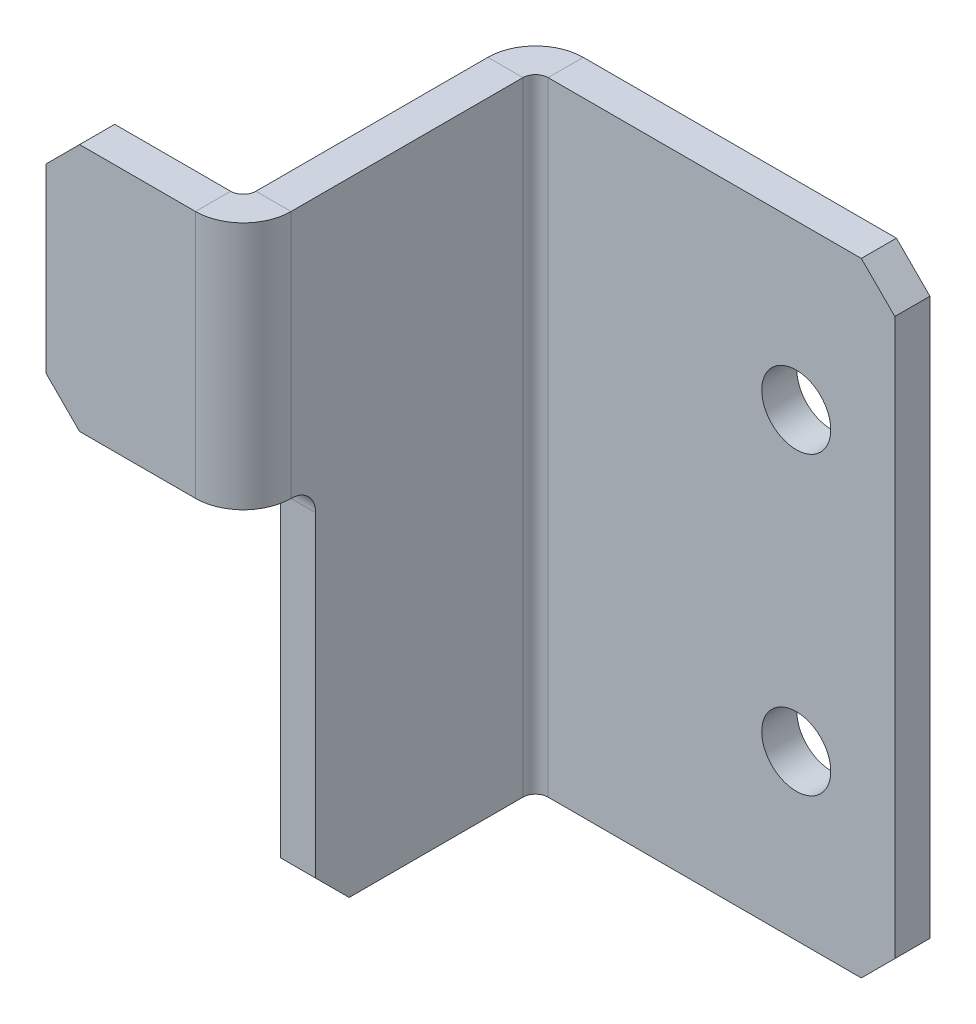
ISO-10303-21;
HEADER;
FILE_DESCRIPTION(('STEP AP214'),'2;1');
FILE_NAME('part.step','',(''),(''),'','','');
FILE_SCHEMA(('AUTOMOTIVE_DESIGN { 1 0 10303 214 1 1 1 1 }'));
ENDSEC;
DATA;
#1=APPLICATION_CONTEXT('core data for automotive mechanical design processes');
#2=APPLICATION_PROTOCOL_DEFINITION('international standard','automotive_design',2000,#1);
#3=PRODUCT_CONTEXT('',#1,'mechanical');
#4=PRODUCT('Part','Part','',(#3));
#5=PRODUCT_RELATED_PRODUCT_CATEGORY('part','',(#4));
#6=PRODUCT_DEFINITION_FORMATION('','',#4);
#7=PRODUCT_DEFINITION_CONTEXT('part definition',#1,'design');
#8=PRODUCT_DEFINITION('design','',#6,#7);
#9=PRODUCT_DEFINITION_SHAPE('','',#8);
#10=(LENGTH_UNIT() NAMED_UNIT(*) SI_UNIT(.MILLI.,.METRE.));
#11=(NAMED_UNIT(*) PLANE_ANGLE_UNIT() SI_UNIT($,.RADIAN.));
#12=(NAMED_UNIT(*) SI_UNIT($,.STERADIAN.) SOLID_ANGLE_UNIT());
#13=UNCERTAINTY_MEASURE_WITH_UNIT(LENGTH_MEASURE(1.E-05),#10,'distance_accuracy_value','');
#14=(GEOMETRIC_REPRESENTATION_CONTEXT(3) GLOBAL_UNCERTAINTY_ASSIGNED_CONTEXT((#13)) GLOBAL_UNIT_ASSIGNED_CONTEXT((#10,
#11,#12)) REPRESENTATION_CONTEXT('',''));
#15=CARTESIAN_POINT('',(0.,0.,0.));
#16=DIRECTION('',(0.,0.,1.));
#17=DIRECTION('',(1.,0.,0.));
#18=AXIS2_PLACEMENT_3D('',#15,#16,#17);
#19=CARTESIAN_POINT('',(-12.7,-20.066,2.26060000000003));
#20=DIRECTION('',(0.,1.,0.));
#21=DIRECTION('',(0.,0.,1.));
#22=AXIS2_PLACEMENT_3D('',#19,#20,#21);
#23=PLANE('',#22);
#24=DIRECTION('',(0.,0.,-1.));
#25=VECTOR('',#24,1.);
#26=CARTESIAN_POINT('',(-12.7,-20.066,0.));
#27=LINE('',#26,#25);
#28=CARTESIAN_POINT('',(-12.7,-20.066,14.2621000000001));
#29=VERTEX_POINT('',#28);
#30=CARTESIAN_POINT('',(-12.7,-20.066,3.07340000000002));
#31=VERTEX_POINT('',#30);
#32=EDGE_CURVE('E271',#29,#31,#27,.T.);
#33=ORIENTED_EDGE('',*,*,#32,.T.);
#34=DIRECTION('',(-1.,0.,0.));
#35=VECTOR('',#34,1.);
#36=CARTESIAN_POINT('',(-12.7,-20.066,3.07340000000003));
#37=LINE('',#36,#35);
#38=CARTESIAN_POINT('',(-10.4394,-20.066,3.07340000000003));
#39=VERTEX_POINT('',#38);
#40=EDGE_CURVE('E287',#39,#31,#37,.T.);
#41=ORIENTED_EDGE('',*,*,#40,.F.);
#42=DIRECTION('',(0.,0.,1.));
#43=VECTOR('',#42,1.);
#44=CARTESIAN_POINT('',(-10.4394,-20.066,2.26060000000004));
#45=LINE('',#44,#43);
#46=CARTESIAN_POINT('',(-10.4394,-20.066,14.2621000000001));
#47=VERTEX_POINT('',#46);
#48=EDGE_CURVE('E266',#47,#39,#45,.F.);
#49=ORIENTED_EDGE('',*,*,#48,.F.);
#50=DIRECTION('',(1.,0.,0.));
#51=VECTOR('',#50,1.);
#52=CARTESIAN_POINT('',(-12.7,-20.066,14.2621000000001));
#53=LINE('',#52,#51);
#54=EDGE_CURVE('E336',#29,#47,#53,.T.);
#55=ORIENTED_EDGE('',*,*,#54,.F.);
#56=EDGE_LOOP('',(#33,#41,#49,#55));
#57=FACE_BOUND('',#56,.T.);
#58=ADVANCED_FACE('F39',(#57),#23,.F.);
#59=CARTESIAN_POINT('',(-12.7,20.066,21.082));
#60=DIRECTION('',(0.,-1.,0.));
#61=DIRECTION('',(0.,0.,-1.));
#62=AXIS2_PLACEMENT_3D('',#59,#60,#61);
#63=PLANE('',#62);
#64=DIRECTION('',(1.,0.,0.));
#65=VECTOR('',#64,1.);
#66=CARTESIAN_POINT('',(-12.7,20.066,18.0086));
#67=LINE('',#66,#65);
#68=CARTESIAN_POINT('',(-12.7,20.066,18.0086));
#69=VERTEX_POINT('',#68);
#70=CARTESIAN_POINT('',(-10.4394,20.066,18.0086));
#71=VERTEX_POINT('',#70);
#72=EDGE_CURVE('E296',#69,#71,#67,.T.);
#73=ORIENTED_EDGE('',*,*,#72,.T.);
#74=DIRECTION('',(0.,0.,-1.));
#75=VECTOR('',#74,1.);
#76=CARTESIAN_POINT('',(-10.4394,20.066,21.082));
#77=LINE('',#76,#75);
#78=CARTESIAN_POINT('',(-10.4394,20.066,3.0734));
#79=VERTEX_POINT('',#78);
#80=EDGE_CURVE('E274',#79,#71,#77,.F.);
#81=ORIENTED_EDGE('',*,*,#80,.F.);
#82=DIRECTION('',(-1.,0.,0.));
#83=VECTOR('',#82,1.);
#84=CARTESIAN_POINT('',(-10.4394,20.066,3.07340000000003));
#85=LINE('',#84,#83);
#86=CARTESIAN_POINT('',(-12.7,20.066,3.07340000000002));
#87=VERTEX_POINT('',#86);
#88=EDGE_CURVE('E281',#79,#87,#85,.T.);
#89=ORIENTED_EDGE('',*,*,#88,.T.);
#90=DIRECTION('',(0.,0.,1.));
#91=VECTOR('',#90,1.);
#92=CARTESIAN_POINT('',(-12.7,20.066,0.));
#93=LINE('',#92,#91);
#94=EDGE_CURVE('E267',#87,#69,#93,.T.);
#95=ORIENTED_EDGE('',*,*,#94,.T.);
#96=EDGE_LOOP('',(#73,#81,#89,#95));
#97=FACE_BOUND('',#96,.T.);
#98=ADVANCED_FACE('F365',(#97),#63,.F.);
#99=CARTESIAN_POINT('',(-12.7,0.,0.));
#100=DIRECTION('',(1.,0.,0.));
#101=DIRECTION('',(0.,0.,1.));
#102=AXIS2_PLACEMENT_3D('',#99,#100,#101);
#103=PLANE('',#102);
#104=DIRECTION('',(0.,-1.,0.));
#105=VECTOR('',#104,1.);
#106=CARTESIAN_POINT('',(-12.7000000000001,-20.066,16.4211000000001));
#107=LINE('',#106,#105);
#108=CARTESIAN_POINT('',(-12.7000000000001,2.47650000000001,16.4211000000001));
#109=VERTEX_POINT('',#108);
#110=CARTESIAN_POINT('',(-12.7000000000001,-17.907,16.4211000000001));
#111=VERTEX_POINT('',#110);
#112=EDGE_CURVE('E257',#109,#111,#107,.T.);
#113=ORIENTED_EDGE('',*,*,#112,.F.);
#114=CARTESIAN_POINT('',(-12.7000000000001,2.47650000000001,18.0086000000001));
#115=DIRECTION('',(-1.,0.,0.));
#116=DIRECTION('',(0.,0.,1.));
#117=AXIS2_PLACEMENT_3D('',#114,#115,#116);
#118=CIRCLE('',#117,1.5875);
#119=CARTESIAN_POINT('',(-12.7000000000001,4.06400000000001,18.0086000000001));
#120=VERTEX_POINT('',#119);
#121=EDGE_CURVE('E254',#120,#109,#118,.T.);
#122=ORIENTED_EDGE('',*,*,#121,.F.);
#123=DIRECTION('',(0.,1.,0.));
#124=VECTOR('',#123,1.);
#125=CARTESIAN_POINT('',(-12.7000000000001,-20.066,18.0086));
#126=LINE('',#125,#124);
#127=EDGE_CURVE('E293',#120,#69,#126,.T.);
#128=ORIENTED_EDGE('',*,*,#127,.T.);
#129=ORIENTED_EDGE('',*,*,#94,.F.);
#130=DIRECTION('',(0.,-1.,0.));
#131=VECTOR('',#130,1.);
#132=CARTESIAN_POINT('',(-12.7,-20.066,3.07340000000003));
#133=LINE('',#132,#131);
#134=EDGE_CURVE('E284',#87,#31,#133,.T.);
#135=ORIENTED_EDGE('',*,*,#134,.T.);
#136=ORIENTED_EDGE('',*,*,#32,.F.);
#137=DIRECTION('',(0.,0.707106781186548,0.707106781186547));
#138=VECTOR('',#137,1.);
#139=CARTESIAN_POINT('',(-12.7,-20.066,14.2621000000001));
#140=LINE('',#139,#138);
#141=EDGE_CURVE('E11',#111,#29,#140,.F.);
#142=ORIENTED_EDGE('',*,*,#141,.F.);
#143=EDGE_LOOP('',(#113,#122,#128,#129,#135,#136,#142));
#144=FACE_BOUND('',#143,.T.);
#145=ADVANCED_FACE('F352',(#144),#103,.F.);
#146=CARTESIAN_POINT('',(-10.4394,0.,0.));
#147=DIRECTION('',(1.,0.,0.));
#148=DIRECTION('',(0.,0.,1.));
#149=AXIS2_PLACEMENT_3D('',#146,#147,#148);
#150=PLANE('',#149);
#151=ORIENTED_EDGE('',*,*,#48,.T.);
#152=DIRECTION('',(0.,1.,0.));
#153=VECTOR('',#152,1.);
#154=CARTESIAN_POINT('',(-10.4394,-20.066,3.07340000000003));
#155=LINE('',#154,#153);
#156=EDGE_CURVE('E270',#39,#79,#155,.T.);
#157=ORIENTED_EDGE('',*,*,#156,.T.);
#158=ORIENTED_EDGE('',*,*,#80,.T.);
#159=DIRECTION('',(0.,1.,0.));
#160=VECTOR('',#159,1.);
#161=CARTESIAN_POINT('',(-10.4394000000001,-20.066,18.0086000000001));
#162=LINE('',#161,#160);
#163=CARTESIAN_POINT('',(-10.4394000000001,4.06400000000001,18.0086000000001));
#164=VERTEX_POINT('',#163);
#165=EDGE_CURVE('E290',#164,#71,#162,.T.);
#166=ORIENTED_EDGE('',*,*,#165,.F.);
#167=CARTESIAN_POINT('',(-10.4394000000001,2.47650000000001,18.0086000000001));
#168=DIRECTION('',(-1.,0.,0.));
#169=DIRECTION('',(0.,0.,1.));
#170=AXIS2_PLACEMENT_3D('',#167,#168,#169);
#171=CIRCLE('',#170,1.5875);
#172=CARTESIAN_POINT('',(-10.4394000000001,2.47650000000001,16.4211000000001));
#173=VERTEX_POINT('',#172);
#174=EDGE_CURVE('E227',#164,#173,#171,.T.);
#175=ORIENTED_EDGE('',*,*,#174,.T.);
#176=DIRECTION('',(0.,-1.,0.));
#177=VECTOR('',#176,1.);
#178=CARTESIAN_POINT('',(-10.4394000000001,-20.066,16.4211000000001));
#179=LINE('',#178,#177);
#180=CARTESIAN_POINT('',(-10.4394000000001,-17.907,16.4211000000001));
#181=VERTEX_POINT('',#180);
#182=EDGE_CURVE('E258',#173,#181,#179,.T.);
#183=ORIENTED_EDGE('',*,*,#182,.T.);
#184=DIRECTION('',(0.,-0.707106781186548,-0.707106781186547));
#185=VECTOR('',#184,1.);
#186=CARTESIAN_POINT('',(-10.4394,-17.16405,17.16405));
#187=LINE('',#186,#185);
#188=EDGE_CURVE('E339',#47,#181,#187,.F.);
#189=ORIENTED_EDGE('',*,*,#188,.F.);
#190=EDGE_LOOP('',(#151,#157,#158,#166,#175,#183,#189));
#191=FACE_BOUND('',#190,.T.);
#192=ADVANCED_FACE('F343',(#191),#150,.T.);
#193=CARTESIAN_POINT('',(-12.7000000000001,-20.066,16.4211000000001));
#194=DIRECTION('',(0.,0.,-1.));
#195=DIRECTION('',(1.,0.,0.));
#196=AXIS2_PLACEMENT_3D('',#193,#194,#195);
#197=PLANE('',#196);
#198=ORIENTED_EDGE('',*,*,#182,.F.);
#199=DIRECTION('',(1.,0.,0.));
#200=VECTOR('',#199,1.);
#201=CARTESIAN_POINT('',(-12.7000000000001,2.47650000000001,16.4211000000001));
#202=LINE('',#201,#200);
#203=EDGE_CURVE('E260',#109,#173,#202,.T.);
#204=ORIENTED_EDGE('',*,*,#203,.F.);
#205=ORIENTED_EDGE('',*,*,#112,.T.);
#206=DIRECTION('',(-1.,0.,0.));
#207=VECTOR('',#206,1.);
#208=CARTESIAN_POINT('',(-12.7000000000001,-17.907,16.4211000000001));
#209=LINE('',#208,#207);
#210=EDGE_CURVE('E47',#181,#111,#209,.T.);
#211=ORIENTED_EDGE('',*,*,#210,.F.);
#212=EDGE_LOOP('',(#198,#204,#205,#211));
#213=FACE_BOUND('',#212,.T.);
#214=ADVANCED_FACE('F345',(#213),#197,.F.);
#215=CARTESIAN_POINT('',(-12.7000000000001,2.47650000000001,18.0086000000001));
#216=DIRECTION('',(1.,0.,0.));
#217=DIRECTION('',(0.,0.,1.));
#218=AXIS2_PLACEMENT_3D('',#215,#216,#217);
#219=CYLINDRICAL_SURFACE('',#218,1.5875);
#220=ORIENTED_EDGE('',*,*,#174,.F.);
#221=DIRECTION('',(1.,0.,0.));
#222=VECTOR('',#221,1.);
#223=CARTESIAN_POINT('',(-12.7000000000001,4.06400000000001,18.0086000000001));
#224=LINE('',#223,#222);
#225=EDGE_CURVE('E203',#120,#164,#224,.T.);
#226=ORIENTED_EDGE('',*,*,#225,.F.);
#227=ORIENTED_EDGE('',*,*,#121,.T.);
#228=ORIENTED_EDGE('',*,*,#203,.T.);
#229=EDGE_LOOP('',(#220,#226,#227,#228));
#230=FACE_BOUND('',#229,.T.);
#231=ADVANCED_FACE('F349',(#230),#219,.F.);
#232=CARTESIAN_POINT('',(12.7,20.066,2.2606));
#233=DIRECTION('',(-1.,0.,0.));
#234=DIRECTION('',(0.,0.,-1.));
#235=AXIS2_PLACEMENT_3D('',#232,#233,#234);
#236=PLANE('',#235);
#237=DIRECTION('',(0.,-1.,0.));
#238=VECTOR('',#237,1.);
#239=CARTESIAN_POINT('',(12.7,20.066,0.));
#240=LINE('',#239,#238);
#241=CARTESIAN_POINT('',(12.7,17.907,0.));
#242=VERTEX_POINT('',#241);
#243=CARTESIAN_POINT('',(12.7,-17.907,0.));
#244=VERTEX_POINT('',#243);
#245=EDGE_CURVE('E246',#242,#244,#240,.T.);
#246=ORIENTED_EDGE('',*,*,#245,.F.);
#247=DIRECTION('',(0.,0.,-1.));
#248=VECTOR('',#247,1.);
#249=CARTESIAN_POINT('',(12.7,17.907,2.2606));
#250=LINE('',#249,#248);
#251=CARTESIAN_POINT('',(12.7,17.907,2.2606));
#252=VERTEX_POINT('',#251);
#253=EDGE_CURVE('E317',#252,#242,#250,.T.);
#254=ORIENTED_EDGE('',*,*,#253,.F.);
#255=DIRECTION('',(0.,-1.,0.));
#256=VECTOR('',#255,1.);
#257=CARTESIAN_POINT('',(12.7,20.066,2.2606));
#258=LINE('',#257,#256);
#259=CARTESIAN_POINT('',(12.7,-17.907,2.2606));
#260=VERTEX_POINT('',#259);
#261=EDGE_CURVE('E237',#252,#260,#258,.T.);
#262=ORIENTED_EDGE('',*,*,#261,.T.);
#263=DIRECTION('',(0.,0.,1.));
#264=VECTOR('',#263,1.);
#265=CARTESIAN_POINT('',(12.7,-17.907,2.2606));
#266=LINE('',#265,#264);
#267=EDGE_CURVE('E330',#244,#260,#266,.T.);
#268=ORIENTED_EDGE('',*,*,#267,.F.);
#269=EDGE_LOOP('',(#246,#254,#262,#268));
#270=FACE_BOUND('',#269,.T.);
#271=ADVANCED_FACE('F465',(#270),#236,.F.);
#272=CARTESIAN_POINT('',(12.7,-20.066,2.2606));
#273=DIRECTION('',(0.,0.,1.));
#274=DIRECTION('',(-1.,0.,0.));
#275=AXIS2_PLACEMENT_3D('',#272,#273,#274);
#276=PLANE('',#275);
#277=CARTESIAN_POINT('',(6.35000000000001,-9.525,2.2606));
#278=DIRECTION('',(0.,0.,-1.));
#279=DIRECTION('',(-1.,0.,0.));
#280=AXIS2_PLACEMENT_3D('',#277,#278,#279);
#281=CIRCLE('',#280,2.2225);
#282=CARTESIAN_POINT('',(4.12750000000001,-9.525,2.2606));
#283=VERTEX_POINT('',#282);
#284=EDGE_CURVE('E749',#283,#283,#281,.T.);
#285=ORIENTED_EDGE('',*,*,#284,.T.);
#286=EDGE_LOOP('',(#285));
#287=FACE_BOUND('',#286,.T.);
#288=CARTESIAN_POINT('',(6.35000000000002,9.525,2.2606));
#289=DIRECTION('',(0.,0.,-1.));
#290=DIRECTION('',(-1.,0.,0.));
#291=AXIS2_PLACEMENT_3D('',#288,#289,#290);
#292=CIRCLE('',#291,2.2225);
#293=CARTESIAN_POINT('',(4.12750000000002,9.525,2.2606));
#294=VERTEX_POINT('',#293);
#295=EDGE_CURVE('E751',#294,#294,#292,.T.);
#296=ORIENTED_EDGE('',*,*,#295,.T.);
#297=EDGE_LOOP('',(#296));
#298=FACE_BOUND('',#297,.T.);
#299=ORIENTED_EDGE('',*,*,#261,.F.);
#300=DIRECTION('',(-0.707106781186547,0.707106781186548,0.));
#301=VECTOR('',#300,1.);
#302=CARTESIAN_POINT('',(31.6865,-1.07950000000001,2.2606));
#303=LINE('',#302,#301);
#304=CARTESIAN_POINT('',(10.541,20.066,2.2606));
#305=VERTEX_POINT('',#304);
#306=EDGE_CURVE('E324',#305,#252,#303,.F.);
#307=ORIENTED_EDGE('',*,*,#306,.F.);
#308=DIRECTION('',(1.,0.,0.));
#309=VECTOR('',#308,1.);
#310=CARTESIAN_POINT('',(12.7,20.066,2.2606));
#311=LINE('',#310,#309);
#312=CARTESIAN_POINT('',(-9.6266,20.066,2.26060000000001));
#313=VERTEX_POINT('',#312);
#314=EDGE_CURVE('E240',#313,#305,#311,.T.);
#315=ORIENTED_EDGE('',*,*,#314,.F.);
#316=DIRECTION('',(0.,-1.,0.));
#317=VECTOR('',#316,1.);
#318=CARTESIAN_POINT('',(-9.6266,20.066,2.26060000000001));
#319=LINE('',#318,#317);
#320=CARTESIAN_POINT('',(-9.6266,-20.066,2.2606));
#321=VERTEX_POINT('',#320);
#322=EDGE_CURVE('E221',#313,#321,#319,.T.);
#323=ORIENTED_EDGE('',*,*,#322,.T.);
#324=DIRECTION('',(-1.,0.,0.));
#325=VECTOR('',#324,1.);
#326=CARTESIAN_POINT('',(12.7,-20.066,2.2606));
#327=LINE('',#326,#325);
#328=CARTESIAN_POINT('',(10.541,-20.066,2.2606));
#329=VERTEX_POINT('',#328);
#330=EDGE_CURVE('E243',#329,#321,#327,.T.);
#331=ORIENTED_EDGE('',*,*,#330,.F.);
#332=DIRECTION('',(0.707106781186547,0.707106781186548,0.));
#333=VECTOR('',#332,1.);
#334=CARTESIAN_POINT('',(11.6205,-18.9865,2.2606));
#335=LINE('',#334,#333);
#336=EDGE_CURVE('E333',#260,#329,#335,.F.);
#337=ORIENTED_EDGE('',*,*,#336,.F.);
#338=EDGE_LOOP('',(#299,#307,#315,#323,#331,#337));
#339=FACE_BOUND('',#338,.T.);
#340=ADVANCED_FACE('F402',(#287,#298,#339),#276,.T.);
#341=CARTESIAN_POINT('',(12.7,20.066,2.2606));
#342=DIRECTION('',(0.,-1.,0.));
#343=DIRECTION('',(0.,0.,-1.));
#344=AXIS2_PLACEMENT_3D('',#341,#342,#343);
#345=PLANE('',#344);
#346=DIRECTION('',(1.,0.,0.));
#347=VECTOR('',#346,1.);
#348=CARTESIAN_POINT('',(12.7,20.066,0.));
#349=LINE('',#348,#347);
#350=CARTESIAN_POINT('',(-9.6266,20.066,0.));
#351=VERTEX_POINT('',#350);
#352=CARTESIAN_POINT('',(10.541,20.066,0.));
#353=VERTEX_POINT('',#352);
#354=EDGE_CURVE('E231',#351,#353,#349,.T.);
#355=ORIENTED_EDGE('',*,*,#354,.F.);
#356=DIRECTION('',(0.,0.,-1.));
#357=VECTOR('',#356,1.);
#358=CARTESIAN_POINT('',(-9.6266,20.066,2.26060000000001));
#359=LINE('',#358,#357);
#360=EDGE_CURVE('E234',#313,#351,#359,.T.);
#361=ORIENTED_EDGE('',*,*,#360,.F.);
#362=ORIENTED_EDGE('',*,*,#314,.T.);
#363=DIRECTION('',(0.,0.,1.));
#364=VECTOR('',#363,1.);
#365=CARTESIAN_POINT('',(10.541,20.066,2.2606));
#366=LINE('',#365,#364);
#367=EDGE_CURVE('E322',#353,#305,#366,.T.);
#368=ORIENTED_EDGE('',*,*,#367,.F.);
#369=EDGE_LOOP('',(#355,#361,#362,#368));
#370=FACE_BOUND('',#369,.T.);
#371=ADVANCED_FACE('F406',(#370),#345,.F.);
#372=CARTESIAN_POINT('',(12.7,-20.066,0.));
#373=DIRECTION('',(0.,0.,1.));
#374=DIRECTION('',(-1.,0.,0.));
#375=AXIS2_PLACEMENT_3D('',#372,#373,#374);
#376=PLANE('',#375);
#377=CARTESIAN_POINT('',(6.35000000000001,-9.525,0.));
#378=DIRECTION('',(0.,0.,-1.));
#379=DIRECTION('',(-1.,0.,0.));
#380=AXIS2_PLACEMENT_3D('',#377,#378,#379);
#381=CIRCLE('',#380,2.2225);
#382=CARTESIAN_POINT('',(4.12750000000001,-9.525,0.));
#383=VERTEX_POINT('',#382);
#384=EDGE_CURVE('E746',#383,#383,#381,.T.);
#385=ORIENTED_EDGE('',*,*,#384,.F.);
#386=EDGE_LOOP('',(#385));
#387=FACE_BOUND('',#386,.T.);
#388=CARTESIAN_POINT('',(6.35000000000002,9.525,0.));
#389=DIRECTION('',(0.,0.,-1.));
#390=DIRECTION('',(-1.,0.,0.));
#391=AXIS2_PLACEMENT_3D('',#388,#389,#390);
#392=CIRCLE('',#391,2.2225);
#393=CARTESIAN_POINT('',(4.12750000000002,9.525,0.));
#394=VERTEX_POINT('',#393);
#395=EDGE_CURVE('E191',#394,#394,#392,.T.);
#396=ORIENTED_EDGE('',*,*,#395,.F.);
#397=EDGE_LOOP('',(#396));
#398=FACE_BOUND('',#397,.T.);
#399=DIRECTION('',(-1.,0.,0.));
#400=VECTOR('',#399,1.);
#401=CARTESIAN_POINT('',(12.7,-20.066,0.));
#402=LINE('',#401,#400);
#403=CARTESIAN_POINT('',(10.541,-20.066,0.));
#404=VERTEX_POINT('',#403);
#405=CARTESIAN_POINT('',(-9.6266,-20.066,0.));
#406=VERTEX_POINT('',#405);
#407=EDGE_CURVE('E224',#404,#406,#402,.T.);
#408=ORIENTED_EDGE('',*,*,#407,.T.);
#409=DIRECTION('',(0.,-1.,0.));
#410=VECTOR('',#409,1.);
#411=CARTESIAN_POINT('',(-9.6266,20.066,0.));
#412=LINE('',#411,#410);
#413=EDGE_CURVE('E228',#351,#406,#412,.T.);
#414=ORIENTED_EDGE('',*,*,#413,.F.);
#415=ORIENTED_EDGE('',*,*,#354,.T.);
#416=DIRECTION('',(0.707106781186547,-0.707106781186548,0.));
#417=VECTOR('',#416,1.);
#418=CARTESIAN_POINT('',(12.7,17.907,0.));
#419=LINE('',#418,#417);
#420=EDGE_CURVE('E320',#242,#353,#419,.F.);
#421=ORIENTED_EDGE('',*,*,#420,.F.);
#422=ORIENTED_EDGE('',*,*,#245,.T.);
#423=DIRECTION('',(-0.707106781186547,-0.707106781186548,0.));
#424=VECTOR('',#423,1.);
#425=CARTESIAN_POINT('',(10.541,-20.066,0.));
#426=LINE('',#425,#424);
#427=EDGE_CURVE('E328',#404,#244,#426,.F.);
#428=ORIENTED_EDGE('',*,*,#427,.F.);
#429=EDGE_LOOP('',(#408,#414,#415,#421,#422,#428));
#430=FACE_BOUND('',#429,.T.);
#431=ADVANCED_FACE('F409',(#387,#398,#430),#376,.F.);
#432=CARTESIAN_POINT('',(12.7,-20.066,2.2606));
#433=DIRECTION('',(0.,1.,0.));
#434=DIRECTION('',(0.,0.,1.));
#435=AXIS2_PLACEMENT_3D('',#432,#433,#434);
#436=PLANE('',#435);
#437=ORIENTED_EDGE('',*,*,#330,.T.);
#438=DIRECTION('',(0.,0.,-1.));
#439=VECTOR('',#438,1.);
#440=CARTESIAN_POINT('',(-9.6266,-20.066,2.2606));
#441=LINE('',#440,#439);
#442=EDGE_CURVE('E249',#321,#406,#441,.T.);
#443=ORIENTED_EDGE('',*,*,#442,.T.);
#444=ORIENTED_EDGE('',*,*,#407,.F.);
#445=DIRECTION('',(0.,0.,-1.));
#446=VECTOR('',#445,1.);
#447=CARTESIAN_POINT('',(10.541,-20.066,2.2606));
#448=LINE('',#447,#446);
#449=EDGE_CURVE('E326',#329,#404,#448,.T.);
#450=ORIENTED_EDGE('',*,*,#449,.F.);
#451=EDGE_LOOP('',(#437,#443,#444,#450));
#452=FACE_BOUND('',#451,.T.);
#453=ADVANCED_FACE('F450',(#452),#436,.F.);
#454=CARTESIAN_POINT('',(-9.6266,20.066,3.07340000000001));
#455=DIRECTION('',(0.,-1.,0.));
#456=DIRECTION('',(0.,0.,-1.));
#457=AXIS2_PLACEMENT_3D('',#454,#455,#456);
#458=PLANE('',#457);
#459=ORIENTED_EDGE('',*,*,#88,.F.);
#460=CARTESIAN_POINT('',(-9.6266,20.066,3.07340000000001));
#461=DIRECTION('',(0.,-1.,0.));
#462=DIRECTION('',(0.,0.,1.));
#463=AXIS2_PLACEMENT_3D('',#460,#461,#462);
#464=CIRCLE('',#463,0.8128);
#465=EDGE_CURVE('E216',#79,#313,#464,.T.);
#466=ORIENTED_EDGE('',*,*,#465,.T.);
#467=ORIENTED_EDGE('',*,*,#360,.T.);
#468=CARTESIAN_POINT('',(-9.6266,20.066,3.07340000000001));
#469=DIRECTION('',(0.,-1.,0.));
#470=DIRECTION('',(0.,0.,1.));
#471=AXIS2_PLACEMENT_3D('',#468,#469,#470);
#472=CIRCLE('',#471,3.0734);
#473=EDGE_CURVE('E207',#87,#351,#472,.T.);
#474=ORIENTED_EDGE('',*,*,#473,.F.);
#475=EDGE_LOOP('',(#459,#466,#467,#474));
#476=FACE_BOUND('',#475,.T.);
#477=ADVANCED_FACE('F361',(#476),#458,.F.);
#478=CARTESIAN_POINT('',(-9.6266,-20.066,3.0734));
#479=DIRECTION('',(0.,1.,0.));
#480=DIRECTION('',(0.,0.,1.));
#481=AXIS2_PLACEMENT_3D('',#478,#479,#480);
#482=PLANE('',#481);
#483=CARTESIAN_POINT('',(-9.6266,-20.066,3.0734));
#484=DIRECTION('',(0.,-1.,0.));
#485=DIRECTION('',(0.,0.,1.));
#486=AXIS2_PLACEMENT_3D('',#483,#484,#485);
#487=CIRCLE('',#486,3.0734);
#488=EDGE_CURVE('E219',#406,#31,#487,.F.);
#489=ORIENTED_EDGE('',*,*,#488,.F.);
#490=ORIENTED_EDGE('',*,*,#442,.F.);
#491=CARTESIAN_POINT('',(-9.6266,-20.066,3.0734));
#492=DIRECTION('',(0.,1.,0.));
#493=DIRECTION('',(0.,0.,-1.));
#494=AXIS2_PLACEMENT_3D('',#491,#492,#493);
#495=CIRCLE('',#494,0.812800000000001);
#496=EDGE_CURVE('E218',#321,#39,#495,.T.);
#497=ORIENTED_EDGE('',*,*,#496,.T.);
#498=ORIENTED_EDGE('',*,*,#40,.T.);
#499=EDGE_LOOP('',(#489,#490,#497,#498));
#500=FACE_BOUND('',#499,.T.);
#501=ADVANCED_FACE('F393',(#500),#482,.F.);
#502=CARTESIAN_POINT('',(-9.6266,-40.2799981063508,3.07339999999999));
#503=DIRECTION('',(0.,1.,0.));
#504=DIRECTION('',(0.,0.,1.));
#505=AXIS2_PLACEMENT_3D('',#502,#503,#504);
#506=CYLINDRICAL_SURFACE('',#505,0.8128);
#507=ORIENTED_EDGE('',*,*,#322,.F.);
#508=ORIENTED_EDGE('',*,*,#465,.F.);
#509=ORIENTED_EDGE('',*,*,#156,.F.);
#510=ORIENTED_EDGE('',*,*,#496,.F.);
#511=EDGE_LOOP('',(#507,#508,#509,#510));
#512=FACE_BOUND('',#511,.T.);
#513=ADVANCED_FACE('F396',(#512),#506,.F.);
#514=CARTESIAN_POINT('',(-9.6266,-40.2799981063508,3.07339999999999));
#515=DIRECTION('',(0.,1.,0.));
#516=DIRECTION('',(0.,0.,1.));
#517=AXIS2_PLACEMENT_3D('',#514,#515,#516);
#518=CYLINDRICAL_SURFACE('',#517,3.0734);
#519=ORIENTED_EDGE('',*,*,#413,.T.);
#520=ORIENTED_EDGE('',*,*,#488,.T.);
#521=ORIENTED_EDGE('',*,*,#134,.F.);
#522=ORIENTED_EDGE('',*,*,#473,.T.);
#523=EDGE_LOOP('',(#519,#520,#521,#522));
#524=FACE_BOUND('',#523,.T.);
#525=ADVANCED_FACE('F412',(#524),#518,.T.);
#526=CARTESIAN_POINT('',(-13.5128,4.06400000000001,18.0086));
#527=DIRECTION('',(0.,-1.,0.));
#528=DIRECTION('',(0.,0.,-1.));
#529=AXIS2_PLACEMENT_3D('',#526,#527,#528);
#530=PLANE('',#529);
#531=ORIENTED_EDGE('',*,*,#225,.T.);
#532=CARTESIAN_POINT('',(-13.5128,4.06400000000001,18.0086));
#533=DIRECTION('',(0.,-1.,0.));
#534=DIRECTION('',(0.,0.,-1.));
#535=AXIS2_PLACEMENT_3D('',#532,#533,#534);
#536=CIRCLE('',#535,3.0734);
#537=CARTESIAN_POINT('',(-13.5128000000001,4.06400000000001,21.082));
#538=VERTEX_POINT('',#537);
#539=EDGE_CURVE('E186',#164,#538,#536,.T.);
#540=ORIENTED_EDGE('',*,*,#539,.T.);
#541=DIRECTION('',(0.,0.,1.));
#542=VECTOR('',#541,1.);
#543=CARTESIAN_POINT('',(-13.5128000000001,4.06400000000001,18.8214));
#544=LINE('',#543,#542);
#545=CARTESIAN_POINT('',(-13.5128000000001,4.06400000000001,18.8214));
#546=VERTEX_POINT('',#545);
#547=EDGE_CURVE('E194',#546,#538,#544,.T.);
#548=ORIENTED_EDGE('',*,*,#547,.F.);
#549=CARTESIAN_POINT('',(-13.5128,4.06400000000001,18.0086));
#550=DIRECTION('',(0.,-1.,0.));
#551=DIRECTION('',(0.,0.,1.));
#552=AXIS2_PLACEMENT_3D('',#549,#550,#551);
#553=CIRCLE('',#552,0.8128);
#554=EDGE_CURVE('E209',#120,#546,#553,.T.);
#555=ORIENTED_EDGE('',*,*,#554,.F.);
#556=EDGE_LOOP('',(#531,#540,#548,#555));
#557=FACE_BOUND('',#556,.T.);
#558=ADVANCED_FACE('F201',(#557),#530,.T.);
#559=CARTESIAN_POINT('',(-13.5128,20.066,18.0086));
#560=DIRECTION('',(0.,1.,0.));
#561=DIRECTION('',(0.,0.,1.));
#562=AXIS2_PLACEMENT_3D('',#559,#560,#561);
#563=PLANE('',#562);
#564=DIRECTION('',(0.,0.,1.));
#565=VECTOR('',#564,1.);
#566=CARTESIAN_POINT('',(-13.5128000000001,20.066,21.082));
#567=LINE('',#566,#565);
#568=CARTESIAN_POINT('',(-13.5128000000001,20.066,18.8214));
#569=VERTEX_POINT('',#568);
#570=CARTESIAN_POINT('',(-13.5128,20.066,21.082));
#571=VERTEX_POINT('',#570);
#572=EDGE_CURVE('E372',#569,#571,#567,.T.);
#573=ORIENTED_EDGE('',*,*,#572,.T.);
#574=CARTESIAN_POINT('',(-13.5128,20.066,18.0086));
#575=DIRECTION('',(0.,1.,0.));
#576=DIRECTION('',(0.,0.,-1.));
#577=AXIS2_PLACEMENT_3D('',#574,#575,#576);
#578=CIRCLE('',#577,3.0734);
#579=EDGE_CURVE('E188',#571,#71,#578,.T.);
#580=ORIENTED_EDGE('',*,*,#579,.T.);
#581=ORIENTED_EDGE('',*,*,#72,.F.);
#582=CARTESIAN_POINT('',(-13.5128,20.066,18.0086));
#583=DIRECTION('',(0.,-1.,0.));
#584=DIRECTION('',(0.,0.,1.));
#585=AXIS2_PLACEMENT_3D('',#582,#583,#584);
#586=CIRCLE('',#585,0.8128);
#587=EDGE_CURVE('E205',#569,#69,#586,.F.);
#588=ORIENTED_EDGE('',*,*,#587,.F.);
#589=EDGE_LOOP('',(#573,#580,#581,#588));
#590=FACE_BOUND('',#589,.T.);
#591=ADVANCED_FACE('F370',(#590),#563,.T.);
#592=CARTESIAN_POINT('',(-13.5128,-4.30463125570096,18.0086));
#593=DIRECTION('',(0.,1.,0.));
#594=DIRECTION('',(0.,0.,1.));
#595=AXIS2_PLACEMENT_3D('',#592,#593,#594);
#596=CYLINDRICAL_SURFACE('',#595,3.0734);
#597=ORIENTED_EDGE('',*,*,#579,.F.);
#598=DIRECTION('',(0.,1.,0.));
#599=VECTOR('',#598,1.);
#600=CARTESIAN_POINT('',(-13.5128000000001,20.066,21.082));
#601=LINE('',#600,#599);
#602=EDGE_CURVE('E173',#538,#571,#601,.T.);
#603=ORIENTED_EDGE('',*,*,#602,.F.);
#604=ORIENTED_EDGE('',*,*,#539,.F.);
#605=ORIENTED_EDGE('',*,*,#165,.T.);
#606=EDGE_LOOP('',(#597,#603,#604,#605));
#607=FACE_BOUND('',#606,.T.);
#608=ADVANCED_FACE('F183',(#607),#596,.T.);
#609=CARTESIAN_POINT('',(-13.5128,-4.30463125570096,18.0086));
#610=DIRECTION('',(0.,1.,0.));
#611=DIRECTION('',(0.,0.,1.));
#612=AXIS2_PLACEMENT_3D('',#609,#610,#611);
#613=CYLINDRICAL_SURFACE('',#612,0.8128);
#614=ORIENTED_EDGE('',*,*,#587,.T.);
#615=ORIENTED_EDGE('',*,*,#127,.F.);
#616=ORIENTED_EDGE('',*,*,#554,.T.);
#617=DIRECTION('',(0.,-1.,0.));
#618=VECTOR('',#617,1.);
#619=CARTESIAN_POINT('',(-13.5128000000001,20.066,18.8214));
#620=LINE('',#619,#618);
#621=EDGE_CURVE('E190',#569,#546,#620,.T.);
#622=ORIENTED_EDGE('',*,*,#621,.F.);
#623=EDGE_LOOP('',(#614,#615,#616,#622));
#624=FACE_BOUND('',#623,.T.);
#625=ADVANCED_FACE('F390',(#624),#613,.F.);
#626=CARTESIAN_POINT('',(-23.1394000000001,20.066,21.082));
#627=DIRECTION('',(1.,0.,0.));
#628=DIRECTION('',(0.,0.,1.));
#629=AXIS2_PLACEMENT_3D('',#626,#627,#628);
#630=PLANE('',#629);
#631=DIRECTION('',(0.,-1.,0.));
#632=VECTOR('',#631,1.);
#633=CARTESIAN_POINT('',(-23.1394000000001,20.066,18.8214));
#634=LINE('',#633,#632);
#635=CARTESIAN_POINT('',(-23.1394000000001,6.22300000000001,18.8214));
#636=VERTEX_POINT('',#635);
#637=CARTESIAN_POINT('',(-23.1394000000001,17.907,18.8214));
#638=VERTEX_POINT('',#637);
#639=EDGE_CURVE('E199',#636,#638,#634,.F.);
#640=ORIENTED_EDGE('',*,*,#639,.F.);
#641=DIRECTION('',(0.,0.,-1.));
#642=VECTOR('',#641,1.);
#643=CARTESIAN_POINT('',(-23.1394000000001,6.22300000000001,21.082));
#644=LINE('',#643,#642);
#645=CARTESIAN_POINT('',(-23.1394000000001,6.22300000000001,21.082));
#646=VERTEX_POINT('',#645);
#647=EDGE_CURVE('E302',#646,#636,#644,.T.);
#648=ORIENTED_EDGE('',*,*,#647,.F.);
#649=DIRECTION('',(0.,1.,0.));
#650=VECTOR('',#649,1.);
#651=CARTESIAN_POINT('',(-23.1394000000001,0.,21.082));
#652=LINE('',#651,#650);
#653=CARTESIAN_POINT('',(-23.1394000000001,17.907,21.082));
#654=VERTEX_POINT('',#653);
#655=EDGE_CURVE('E381',#646,#654,#652,.T.);
#656=ORIENTED_EDGE('',*,*,#655,.T.);
#657=DIRECTION('',(0.,0.,1.));
#658=VECTOR('',#657,1.);
#659=CARTESIAN_POINT('',(-23.1394000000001,17.907,21.082));
#660=LINE('',#659,#658);
#661=EDGE_CURVE('E311',#638,#654,#660,.T.);
#662=ORIENTED_EDGE('',*,*,#661,.F.);
#663=EDGE_LOOP('',(#640,#648,#656,#662));
#664=FACE_BOUND('',#663,.T.);
#665=ADVANCED_FACE('F571',(#664),#630,.F.);
#666=CARTESIAN_POINT('',(0.,0.,21.082));
#667=DIRECTION('',(0.,0.,-1.));
#668=DIRECTION('',(1.,0.,0.));
#669=AXIS2_PLACEMENT_3D('',#666,#667,#668);
#670=PLANE('',#669);
#671=ORIENTED_EDGE('',*,*,#655,.F.);
#672=DIRECTION('',(0.707106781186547,-0.707106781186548,0.));
#673=VECTOR('',#672,1.);
#674=CARTESIAN_POINT('',(-20.9804000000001,4.06400000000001,21.082));
#675=LINE('',#674,#673);
#676=CARTESIAN_POINT('',(-20.9804000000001,4.06400000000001,21.082));
#677=VERTEX_POINT('',#676);
#678=EDGE_CURVE('E175',#677,#646,#675,.F.);
#679=ORIENTED_EDGE('',*,*,#678,.F.);
#680=DIRECTION('',(1.,0.,0.));
#681=VECTOR('',#680,1.);
#682=CARTESIAN_POINT('',(-23.1394000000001,4.06400000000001,21.082));
#683=LINE('',#682,#681);
#684=EDGE_CURVE('E168',#677,#538,#683,.T.);
#685=ORIENTED_EDGE('',*,*,#684,.T.);
#686=ORIENTED_EDGE('',*,*,#602,.T.);
#687=DIRECTION('',(1.,0.,0.));
#688=VECTOR('',#687,1.);
#689=CARTESIAN_POINT('',(0.,20.066,21.082));
#690=LINE('',#689,#688);
#691=CARTESIAN_POINT('',(-20.9804000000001,20.066,21.082));
#692=VERTEX_POINT('',#691);
#693=EDGE_CURVE('E180',#692,#571,#690,.T.);
#694=ORIENTED_EDGE('',*,*,#693,.F.);
#695=DIRECTION('',(-0.707106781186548,-0.707106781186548,0.));
#696=VECTOR('',#695,1.);
#697=CARTESIAN_POINT('',(-20.9804000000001,20.066,21.082));
#698=LINE('',#697,#696);
#699=EDGE_CURVE('E314',#654,#692,#698,.F.);
#700=ORIENTED_EDGE('',*,*,#699,.F.);
#701=EDGE_LOOP('',(#671,#679,#685,#686,#694,#700));
#702=FACE_BOUND('',#701,.T.);
#703=ADVANCED_FACE('F171',(#702),#670,.F.);
#704=CARTESIAN_POINT('',(-23.1394000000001,4.06400000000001,18.8214));
#705=DIRECTION('',(0.,1.,0.));
#706=DIRECTION('',(1.,0.,0.));
#707=AXIS2_PLACEMENT_3D('',#704,#705,#706);
#708=PLANE('',#707);
#709=DIRECTION('',(1.,0.,0.));
#710=VECTOR('',#709,1.);
#711=CARTESIAN_POINT('',(-23.1394000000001,4.06400000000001,18.8214));
#712=LINE('',#711,#710);
#713=CARTESIAN_POINT('',(-20.9804000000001,4.06400000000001,18.8214));
#714=VERTEX_POINT('',#713);
#715=EDGE_CURVE('E179',#714,#546,#712,.T.);
#716=ORIENTED_EDGE('',*,*,#715,.T.);
#717=ORIENTED_EDGE('',*,*,#547,.T.);
#718=ORIENTED_EDGE('',*,*,#684,.F.);
#719=DIRECTION('',(0.,0.,1.));
#720=VECTOR('',#719,1.);
#721=CARTESIAN_POINT('',(-20.9804000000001,4.06400000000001,18.8214));
#722=LINE('',#721,#720);
#723=EDGE_CURVE('E299',#714,#677,#722,.T.);
#724=ORIENTED_EDGE('',*,*,#723,.F.);
#725=EDGE_LOOP('',(#716,#717,#718,#724));
#726=FACE_BOUND('',#725,.T.);
#727=ADVANCED_FACE('F195',(#726),#708,.F.);
#728=CARTESIAN_POINT('',(0.,0.,18.8214));
#729=DIRECTION('',(0.,0.,-1.));
#730=DIRECTION('',(1.,0.,0.));
#731=AXIS2_PLACEMENT_3D('',#728,#729,#730);
#732=PLANE('',#731);
#733=DIRECTION('',(-1.,0.,0.));
#734=VECTOR('',#733,1.);
#735=CARTESIAN_POINT('',(-12.7000000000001,20.066,18.8214));
#736=LINE('',#735,#734);
#737=CARTESIAN_POINT('',(-20.9804000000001,20.066,18.8214));
#738=VERTEX_POINT('',#737);
#739=EDGE_CURVE('E215',#738,#569,#736,.F.);
#740=ORIENTED_EDGE('',*,*,#739,.T.);
#741=ORIENTED_EDGE('',*,*,#621,.T.);
#742=ORIENTED_EDGE('',*,*,#715,.F.);
#743=DIRECTION('',(-0.707106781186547,0.707106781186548,0.));
#744=VECTOR('',#743,1.);
#745=CARTESIAN_POINT('',(-8.45820000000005,-8.45820000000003,18.8214));
#746=LINE('',#745,#744);
#747=EDGE_CURVE('E305',#636,#714,#746,.F.);
#748=ORIENTED_EDGE('',*,*,#747,.F.);
#749=ORIENTED_EDGE('',*,*,#639,.T.);
#750=DIRECTION('',(0.707106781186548,0.707106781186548,0.));
#751=VECTOR('',#750,1.);
#752=CARTESIAN_POINT('',(-20.5232,20.5232,18.8214));
#753=LINE('',#752,#751);
#754=EDGE_CURVE('E309',#738,#638,#753,.F.);
#755=ORIENTED_EDGE('',*,*,#754,.F.);
#756=EDGE_LOOP('',(#740,#741,#742,#748,#749,#755));
#757=FACE_BOUND('',#756,.T.);
#758=ADVANCED_FACE('F387',(#757),#732,.T.);
#759=CARTESIAN_POINT('',(-12.7000000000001,20.066,21.082));
#760=DIRECTION('',(0.,-1.,0.));
#761=DIRECTION('',(0.,0.,-1.));
#762=AXIS2_PLACEMENT_3D('',#759,#760,#761);
#763=PLANE('',#762);
#764=ORIENTED_EDGE('',*,*,#693,.T.);
#765=ORIENTED_EDGE('',*,*,#572,.F.);
#766=ORIENTED_EDGE('',*,*,#739,.F.);
#767=DIRECTION('',(0.,0.,-1.));
#768=VECTOR('',#767,1.);
#769=CARTESIAN_POINT('',(-20.9804000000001,20.066,21.082));
#770=LINE('',#769,#768);
#771=EDGE_CURVE('E307',#692,#738,#770,.T.);
#772=ORIENTED_EDGE('',*,*,#771,.F.);
#773=EDGE_LOOP('',(#764,#765,#766,#772));
#774=FACE_BOUND('',#773,.T.);
#775=ADVANCED_FACE('F609',(#774),#763,.F.);
#776=CARTESIAN_POINT('',(6.35000000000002,9.525,0.));
#777=DIRECTION('',(0.,0.,1.));
#778=DIRECTION('',(-1.,0.,0.));
#779=AXIS2_PLACEMENT_3D('',#776,#777,#778);
#780=CYLINDRICAL_SURFACE('',#779,2.2225);
#781=ORIENTED_EDGE('',*,*,#395,.T.);
#782=EDGE_LOOP('',(#781));
#783=FACE_BOUND('',#782,.T.);
#784=ORIENTED_EDGE('',*,*,#295,.F.);
#785=EDGE_LOOP('',(#784));
#786=FACE_BOUND('',#785,.T.);
#787=ADVANCED_FACE('F619',(#783,#786),#780,.F.);
#788=CARTESIAN_POINT('',(6.35000000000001,-9.525,0.));
#789=DIRECTION('',(0.,0.,1.));
#790=DIRECTION('',(-1.,0.,0.));
#791=AXIS2_PLACEMENT_3D('',#788,#789,#790);
#792=CYLINDRICAL_SURFACE('',#791,2.2225);
#793=ORIENTED_EDGE('',*,*,#384,.T.);
#794=EDGE_LOOP('',(#793));
#795=FACE_BOUND('',#794,.T.);
#796=ORIENTED_EDGE('',*,*,#284,.F.);
#797=EDGE_LOOP('',(#796));
#798=FACE_BOUND('',#797,.T.);
#799=ADVANCED_FACE('F434',(#795,#798),#792,.F.);
#800=CARTESIAN_POINT('',(-20.9804000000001,4.06400000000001,18.8214));
#801=DIRECTION('',(0.707106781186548,0.707106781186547,0.));
#802=DIRECTION('',(0.,0.,1.));
#803=AXIS2_PLACEMENT_3D('',#800,#801,#802);
#804=PLANE('',#803);
#805=ORIENTED_EDGE('',*,*,#747,.T.);
#806=ORIENTED_EDGE('',*,*,#723,.T.);
#807=ORIENTED_EDGE('',*,*,#678,.T.);
#808=ORIENTED_EDGE('',*,*,#647,.T.);
#809=EDGE_LOOP('',(#805,#806,#807,#808));
#810=FACE_BOUND('',#809,.T.);
#811=ADVANCED_FACE('F430',(#810),#804,.F.);
#812=CARTESIAN_POINT('',(-20.9804000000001,20.066,21.082));
#813=DIRECTION('',(0.707106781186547,-0.707106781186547,0.));
#814=DIRECTION('',(0.,0.,-1.));
#815=AXIS2_PLACEMENT_3D('',#812,#813,#814);
#816=PLANE('',#815);
#817=ORIENTED_EDGE('',*,*,#699,.T.);
#818=ORIENTED_EDGE('',*,*,#771,.T.);
#819=ORIENTED_EDGE('',*,*,#754,.T.);
#820=ORIENTED_EDGE('',*,*,#661,.T.);
#821=EDGE_LOOP('',(#817,#818,#819,#820));
#822=FACE_BOUND('',#821,.T.);
#823=ADVANCED_FACE('F433',(#822),#816,.F.);
#824=CARTESIAN_POINT('',(12.7,17.907,2.2606));
#825=DIRECTION('',(-0.707106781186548,-0.707106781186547,0.));
#826=DIRECTION('',(0.,0.,-1.));
#827=AXIS2_PLACEMENT_3D('',#824,#825,#826);
#828=PLANE('',#827);
#829=ORIENTED_EDGE('',*,*,#306,.T.);
#830=ORIENTED_EDGE('',*,*,#253,.T.);
#831=ORIENTED_EDGE('',*,*,#420,.T.);
#832=ORIENTED_EDGE('',*,*,#367,.T.);
#833=EDGE_LOOP('',(#829,#830,#831,#832));
#834=FACE_BOUND('',#833,.T.);
#835=ADVANCED_FACE('F438',(#834),#828,.F.);
#836=CARTESIAN_POINT('',(10.541,-20.066,2.2606));
#837=DIRECTION('',(-0.707106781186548,0.707106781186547,0.));
#838=DIRECTION('',(0.,0.,-1.));
#839=AXIS2_PLACEMENT_3D('',#836,#837,#838);
#840=PLANE('',#839);
#841=ORIENTED_EDGE('',*,*,#336,.T.);
#842=ORIENTED_EDGE('',*,*,#449,.T.);
#843=ORIENTED_EDGE('',*,*,#427,.T.);
#844=ORIENTED_EDGE('',*,*,#267,.T.);
#845=EDGE_LOOP('',(#841,#842,#843,#844));
#846=FACE_BOUND('',#845,.T.);
#847=ADVANCED_FACE('F441',(#846),#840,.F.);
#848=CARTESIAN_POINT('',(-12.7,-20.066,14.2621000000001));
#849=DIRECTION('',(0.,0.707106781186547,-0.707106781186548));
#850=DIRECTION('',(1.,0.,0.));
#851=AXIS2_PLACEMENT_3D('',#848,#849,#850);
#852=PLANE('',#851);
#853=ORIENTED_EDGE('',*,*,#141,.T.);
#854=ORIENTED_EDGE('',*,*,#54,.T.);
#855=ORIENTED_EDGE('',*,*,#188,.T.);
#856=ORIENTED_EDGE('',*,*,#210,.T.);
#857=EDGE_LOOP('',(#853,#854,#855,#856));
#858=FACE_BOUND('',#857,.T.);
#859=ADVANCED_FACE('F41',(#858),#852,.F.);
#860=CLOSED_SHELL('',(#58,#98,#145,#192,#214,#231,#271,#340,#371,#431,#453,#477,#501,#513,#525,
#558,#591,#608,#625,#665,#703,#727,#758,#775,#787,#799,#811,#823,#835,#847,#859));
#861=MANIFOLD_SOLID_BREP('B2',#860);
#862=ADVANCED_BREP_SHAPE_REPRESENTATION('',(#18,#861),#14);
#863=SHAPE_DEFINITION_REPRESENTATION(#9,#862);
ENDSEC;
END-ISO-10303-21;
